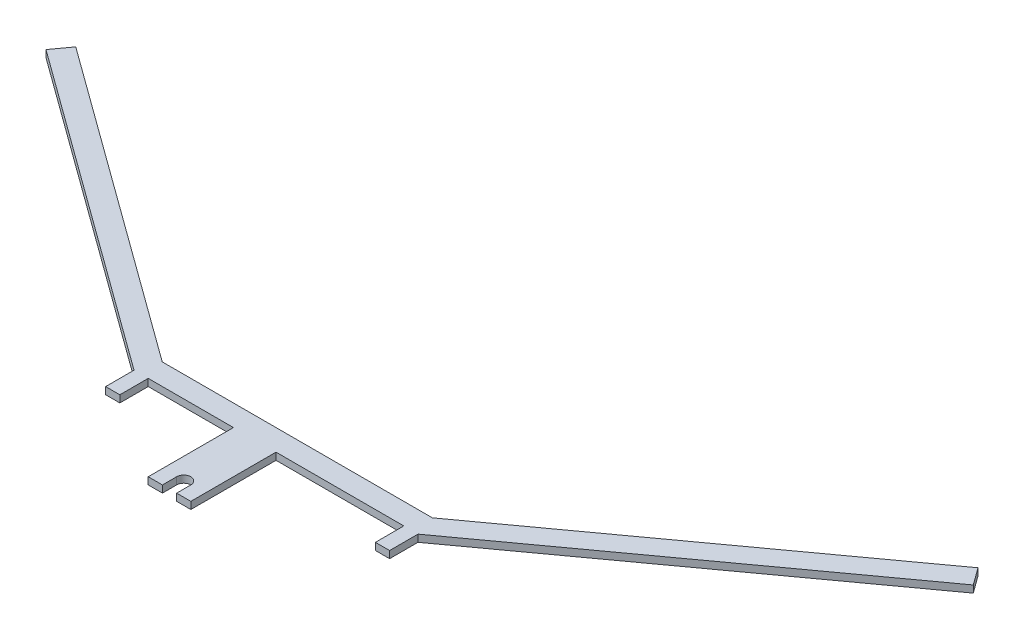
ISO-10303-21;
HEADER;
FILE_DESCRIPTION(('STEP AP214'),'2;1');
FILE_NAME('part.step','',(''),(''),'','','');
FILE_SCHEMA(('AUTOMOTIVE_DESIGN { 1 0 10303 214 1 1 1 1 }'));
ENDSEC;
DATA;
#1=APPLICATION_CONTEXT('core data for automotive mechanical design processes');
#2=APPLICATION_PROTOCOL_DEFINITION('international standard','automotive_design',2000,#1);
#3=PRODUCT_CONTEXT('',#1,'mechanical');
#4=PRODUCT('Part','Part','',(#3));
#5=PRODUCT_RELATED_PRODUCT_CATEGORY('part','',(#4));
#6=PRODUCT_DEFINITION_FORMATION('','',#4);
#7=PRODUCT_DEFINITION_CONTEXT('part definition',#1,'design');
#8=PRODUCT_DEFINITION('design','',#6,#7);
#9=PRODUCT_DEFINITION_SHAPE('','',#8);
#10=(LENGTH_UNIT() NAMED_UNIT(*) SI_UNIT(.MILLI.,.METRE.));
#11=(NAMED_UNIT(*) PLANE_ANGLE_UNIT() SI_UNIT($,.RADIAN.));
#12=(NAMED_UNIT(*) SI_UNIT($,.STERADIAN.) SOLID_ANGLE_UNIT());
#13=UNCERTAINTY_MEASURE_WITH_UNIT(LENGTH_MEASURE(1.E-05),#10,'distance_accuracy_value','');
#14=(GEOMETRIC_REPRESENTATION_CONTEXT(3) GLOBAL_UNCERTAINTY_ASSIGNED_CONTEXT((#13)) GLOBAL_UNIT_ASSIGNED_CONTEXT((#10,
#11,#12)) REPRESENTATION_CONTEXT('',''));
#15=CARTESIAN_POINT('',(0.,0.,0.));
#16=DIRECTION('',(0.,0.,1.));
#17=DIRECTION('',(1.,0.,0.));
#18=AXIS2_PLACEMENT_3D('',#15,#16,#17);
#19=CARTESIAN_POINT('',(0.,6.95820393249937,52.5));
#20=DIRECTION('',(0.,0.,1.));
#21=DIRECTION('',(1.,0.,0.));
#22=AXIS2_PLACEMENT_3D('',#19,#20,#21);
#23=PLANE('',#22);
#24=DIRECTION('',(0.,-1.,0.));
#25=VECTOR('',#24,1.);
#26=CARTESIAN_POINT('',(-2.00000000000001,6.95820393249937,52.5));
#27=LINE('',#26,#25);
#28=CARTESIAN_POINT('',(-2.00000000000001,0.250000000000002,52.5));
#29=VERTEX_POINT('',#28);
#30=CARTESIAN_POINT('',(-2.00000000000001,-0.25,52.5));
#31=VERTEX_POINT('',#30);
#32=EDGE_CURVE('E11',#29,#31,#27,.T.);
#33=ORIENTED_EDGE('',*,*,#32,.F.);
#34=DIRECTION('',(-1.,0.,0.));
#35=VECTOR('',#34,1.);
#36=CARTESIAN_POINT('',(0.,0.25,52.5));
#37=LINE('',#36,#35);
#38=CARTESIAN_POINT('',(-3.00000000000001,0.250000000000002,52.5));
#39=VERTEX_POINT('',#38);
#40=EDGE_CURVE('E240',#29,#39,#37,.T.);
#41=ORIENTED_EDGE('',*,*,#40,.T.);
#42=DIRECTION('',(0.,-1.,0.));
#43=VECTOR('',#42,1.);
#44=CARTESIAN_POINT('',(-3.00000000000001,6.95820393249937,52.5));
#45=LINE('',#44,#43);
#46=CARTESIAN_POINT('',(-3.00000000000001,-0.25,52.5));
#47=VERTEX_POINT('',#46);
#48=EDGE_CURVE('E250',#39,#47,#45,.T.);
#49=ORIENTED_EDGE('',*,*,#48,.T.);
#50=DIRECTION('',(-1.,0.,0.));
#51=VECTOR('',#50,1.);
#52=CARTESIAN_POINT('',(0.,-0.25,52.5));
#53=LINE('',#52,#51);
#54=EDGE_CURVE('E244',#31,#47,#53,.T.);
#55=ORIENTED_EDGE('',*,*,#54,.F.);
#56=EDGE_LOOP('',(#33,#41,#49,#55));
#57=FACE_BOUND('',#56,.T.);
#58=ADVANCED_FACE('F35',(#57),#23,.T.);
#59=CARTESIAN_POINT('',(-9.99999999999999,0.25,46.5));
#60=DIRECTION('',(0.,0.,-1.));
#61=DIRECTION('',(-1.,0.,0.));
#62=AXIS2_PLACEMENT_3D('',#59,#60,#61);
#63=PLANE('',#62);
#64=DIRECTION('',(1.,0.,0.));
#65=VECTOR('',#64,1.);
#66=CARTESIAN_POINT('',(-9.99999999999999,-0.25,46.5));
#67=LINE('',#66,#65);
#68=CARTESIAN_POINT('',(-8.99999999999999,-0.25,46.5));
#69=VERTEX_POINT('',#68);
#70=CARTESIAN_POINT('',(-3.00000000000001,-0.25,46.5));
#71=VERTEX_POINT('',#70);
#72=EDGE_CURVE('E315',#69,#71,#67,.T.);
#73=ORIENTED_EDGE('',*,*,#72,.T.);
#74=DIRECTION('',(0.,-1.,0.));
#75=VECTOR('',#74,1.);
#76=CARTESIAN_POINT('',(-3.00000000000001,6.95820393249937,46.5));
#77=LINE('',#76,#75);
#78=CARTESIAN_POINT('',(-3.00000000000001,0.25,46.5));
#79=VERTEX_POINT('',#78);
#80=EDGE_CURVE('E259',#79,#71,#77,.T.);
#81=ORIENTED_EDGE('',*,*,#80,.F.);
#82=DIRECTION('',(1.,0.,0.));
#83=VECTOR('',#82,1.);
#84=CARTESIAN_POINT('',(-9.99999999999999,0.25,46.5));
#85=LINE('',#84,#83);
#86=CARTESIAN_POINT('',(-8.99999999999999,0.25,46.5));
#87=VERTEX_POINT('',#86);
#88=EDGE_CURVE('E297',#87,#79,#85,.T.);
#89=ORIENTED_EDGE('',*,*,#88,.F.);
#90=DIRECTION('',(0.,1.,0.));
#91=VECTOR('',#90,1.);
#92=CARTESIAN_POINT('',(-8.99999999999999,-2.48606797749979,46.5));
#93=LINE('',#92,#91);
#94=EDGE_CURVE('E270',#69,#87,#93,.T.);
#95=ORIENTED_EDGE('',*,*,#94,.F.);
#96=EDGE_LOOP('',(#73,#81,#89,#95));
#97=FACE_BOUND('',#96,.T.);
#98=ADVANCED_FACE('F414',(#97),#63,.F.);
#99=CARTESIAN_POINT('',(0.,-0.25,46.5));
#100=VERTEX_POINT('',#99);
#101=CARTESIAN_POINT('',(8.99999999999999,-0.25,46.5));
#102=VERTEX_POINT('',#101);
#103=EDGE_CURVE('E55',#100,#102,#67,.T.);
#104=ORIENTED_EDGE('',*,*,#103,.T.);
#105=DIRECTION('',(0.,-1.,0.));
#106=VECTOR('',#105,1.);
#107=CARTESIAN_POINT('',(8.99999999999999,2.48606797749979,46.5));
#108=LINE('',#107,#106);
#109=CARTESIAN_POINT('',(8.99999999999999,0.25,46.5));
#110=VERTEX_POINT('',#109);
#111=EDGE_CURVE('E50',#110,#102,#108,.T.);
#112=ORIENTED_EDGE('',*,*,#111,.F.);
#113=CARTESIAN_POINT('',(0.,0.25,46.5));
#114=VERTEX_POINT('',#113);
#115=EDGE_CURVE('E296',#114,#110,#85,.T.);
#116=ORIENTED_EDGE('',*,*,#115,.F.);
#117=DIRECTION('',(0.,-1.,0.));
#118=VECTOR('',#117,1.);
#119=CARTESIAN_POINT('',(0.,6.95820393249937,46.5));
#120=LINE('',#119,#118);
#121=EDGE_CURVE('E255',#114,#100,#120,.T.);
#122=ORIENTED_EDGE('',*,*,#121,.T.);
#123=EDGE_LOOP('',(#104,#112,#116,#122));
#124=FACE_BOUND('',#123,.T.);
#125=ADVANCED_FACE('F443',(#124),#63,.F.);
#126=CARTESIAN_POINT('',(-31.7734222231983,0.25,28.831720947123));
#127=DIRECTION('',(0.809104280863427,0.,0.587665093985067));
#128=DIRECTION('',(0.587665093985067,0.,-0.809104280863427));
#129=AXIS2_PLACEMENT_3D('',#126,#127,#128);
#130=PLANE('',#129);
#131=DIRECTION('',(-0.587665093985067,0.,0.809104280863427));
#132=VECTOR('',#131,1.);
#133=CARTESIAN_POINT('',(-31.7734222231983,-0.25,28.831720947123));
#134=LINE('',#133,#132);
#135=CARTESIAN_POINT('',(-31.7734222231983,-0.25,28.831720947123));
#136=VERTEX_POINT('',#135);
#137=CARTESIAN_POINT('',(-32.6549198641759,-0.25,30.0453773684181));
#138=VERTEX_POINT('',#137);
#139=EDGE_CURVE('E289',#136,#138,#134,.T.);
#140=ORIENTED_EDGE('',*,*,#139,.T.);
#141=DIRECTION('',(0.,-1.,0.));
#142=VECTOR('',#141,1.);
#143=CARTESIAN_POINT('',(-32.6549198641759,0.25,30.0453773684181));
#144=LINE('',#143,#142);
#145=CARTESIAN_POINT('',(-32.6549198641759,0.25,30.0453773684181));
#146=VERTEX_POINT('',#145);
#147=EDGE_CURVE('E344',#146,#138,#144,.T.);
#148=ORIENTED_EDGE('',*,*,#147,.F.);
#149=DIRECTION('',(-0.587665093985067,0.,0.809104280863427));
#150=VECTOR('',#149,1.);
#151=CARTESIAN_POINT('',(-31.7734222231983,0.25,28.831720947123));
#152=LINE('',#151,#150);
#153=CARTESIAN_POINT('',(-31.7734222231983,0.25,28.831720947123));
#154=VERTEX_POINT('',#153);
#155=EDGE_CURVE('E290',#154,#146,#152,.T.);
#156=ORIENTED_EDGE('',*,*,#155,.F.);
#157=DIRECTION('',(0.,-1.,0.));
#158=VECTOR('',#157,1.);
#159=CARTESIAN_POINT('',(-31.7734222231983,0.25,28.831720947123));
#160=LINE('',#159,#158);
#161=EDGE_CURVE('E310',#154,#136,#160,.T.);
#162=ORIENTED_EDGE('',*,*,#161,.T.);
#163=EDGE_LOOP('',(#140,#148,#156,#162));
#164=FACE_BOUND('',#163,.T.);
#165=ADVANCED_FACE('F37',(#164),#130,.F.);
#166=CARTESIAN_POINT('',(-32.6549198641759,0.25,30.0453773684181));
#167=DIRECTION('',(0.587665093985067,0.,-0.809104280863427));
#168=DIRECTION('',(-0.809104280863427,0.,-0.587665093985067));
#169=AXIS2_PLACEMENT_3D('',#166,#167,#168);
#170=PLANE('',#169);
#171=DIRECTION('',(0.809104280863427,0.,0.587665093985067));
#172=VECTOR('',#171,1.);
#173=CARTESIAN_POINT('',(-32.6549198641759,-0.25,30.0453773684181));
#174=LINE('',#173,#172);
#175=CARTESIAN_POINT('',(-9.99999999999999,-0.25,46.5));
#176=VERTEX_POINT('',#175);
#177=EDGE_CURVE('E313',#138,#176,#174,.T.);
#178=ORIENTED_EDGE('',*,*,#177,.T.);
#179=DIRECTION('',(0.,-1.,0.));
#180=VECTOR('',#179,1.);
#181=CARTESIAN_POINT('',(-9.99999999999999,0.25,46.5));
#182=LINE('',#181,#180);
#183=CARTESIAN_POINT('',(-9.99999999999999,0.25,46.5));
#184=VERTEX_POINT('',#183);
#185=EDGE_CURVE('E341',#184,#176,#182,.T.);
#186=ORIENTED_EDGE('',*,*,#185,.F.);
#187=DIRECTION('',(0.809104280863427,0.,0.587665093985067));
#188=VECTOR('',#187,1.);
#189=CARTESIAN_POINT('',(-32.6549198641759,0.25,30.0453773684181));
#190=LINE('',#189,#188);
#191=EDGE_CURVE('E293',#146,#184,#190,.T.);
#192=ORIENTED_EDGE('',*,*,#191,.F.);
#193=ORIENTED_EDGE('',*,*,#147,.T.);
#194=EDGE_LOOP('',(#178,#186,#192,#193));
#195=FACE_BOUND('',#194,.T.);
#196=ADVANCED_FACE('F397',(#195),#170,.F.);
#197=CARTESIAN_POINT('',(32.654919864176,0.25,30.0453773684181));
#198=DIRECTION('',(-0.587665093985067,0.,-0.809104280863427));
#199=DIRECTION('',(-0.809104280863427,0.,0.587665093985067));
#200=AXIS2_PLACEMENT_3D('',#197,#198,#199);
#201=PLANE('',#200);
#202=DIRECTION('',(0.809104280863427,0.,-0.587665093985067));
#203=VECTOR('',#202,1.);
#204=CARTESIAN_POINT('',(32.654919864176,-0.25,30.0453773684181));
#205=LINE('',#204,#203);
#206=CARTESIAN_POINT('',(9.99999999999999,-0.25,46.5));
#207=VERTEX_POINT('',#206);
#208=CARTESIAN_POINT('',(32.654919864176,-0.25,30.0453773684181));
#209=VERTEX_POINT('',#208);
#210=EDGE_CURVE('E317',#207,#209,#205,.T.);
#211=ORIENTED_EDGE('',*,*,#210,.T.);
#212=DIRECTION('',(0.,-1.,0.));
#213=VECTOR('',#212,1.);
#214=CARTESIAN_POINT('',(32.654919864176,0.25,30.0453773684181));
#215=LINE('',#214,#213);
#216=CARTESIAN_POINT('',(32.654919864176,0.25,30.0453773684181));
#217=VERTEX_POINT('',#216);
#218=EDGE_CURVE('E337',#217,#209,#215,.T.);
#219=ORIENTED_EDGE('',*,*,#218,.F.);
#220=DIRECTION('',(0.809104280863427,0.,-0.587665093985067));
#221=VECTOR('',#220,1.);
#222=CARTESIAN_POINT('',(32.654919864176,0.25,30.0453773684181));
#223=LINE('',#222,#221);
#224=CARTESIAN_POINT('',(9.99999999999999,0.25,46.5));
#225=VERTEX_POINT('',#224);
#226=EDGE_CURVE('E300',#225,#217,#223,.T.);
#227=ORIENTED_EDGE('',*,*,#226,.F.);
#228=DIRECTION('',(0.,-1.,0.));
#229=VECTOR('',#228,1.);
#230=CARTESIAN_POINT('',(10.,0.25,46.5));
#231=LINE('',#230,#229);
#232=EDGE_CURVE('E204',#225,#207,#231,.T.);
#233=ORIENTED_EDGE('',*,*,#232,.T.);
#234=EDGE_LOOP('',(#211,#219,#227,#233));
#235=FACE_BOUND('',#234,.T.);
#236=ADVANCED_FACE('F372',(#235),#201,.F.);
#237=CARTESIAN_POINT('',(31.7734222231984,0.25,28.831720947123));
#238=DIRECTION('',(-0.809104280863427,0.,0.587665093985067));
#239=DIRECTION('',(0.587665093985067,0.,0.809104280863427));
#240=AXIS2_PLACEMENT_3D('',#237,#238,#239);
#241=PLANE('',#240);
#242=DIRECTION('',(-0.587665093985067,0.,-0.809104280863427));
#243=VECTOR('',#242,1.);
#244=CARTESIAN_POINT('',(31.7734222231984,-0.25,28.831720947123));
#245=LINE('',#244,#243);
#246=CARTESIAN_POINT('',(31.7734222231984,-0.25,28.831720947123));
#247=VERTEX_POINT('',#246);
#248=EDGE_CURVE('E319',#209,#247,#245,.T.);
#249=ORIENTED_EDGE('',*,*,#248,.T.);
#250=DIRECTION('',(0.,-1.,0.));
#251=VECTOR('',#250,1.);
#252=CARTESIAN_POINT('',(31.7734222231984,0.25,28.831720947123));
#253=LINE('',#252,#251);
#254=CARTESIAN_POINT('',(31.7734222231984,0.25,28.831720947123));
#255=VERTEX_POINT('',#254);
#256=EDGE_CURVE('E334',#255,#247,#253,.T.);
#257=ORIENTED_EDGE('',*,*,#256,.F.);
#258=DIRECTION('',(-0.587665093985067,0.,-0.809104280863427));
#259=VECTOR('',#258,1.);
#260=CARTESIAN_POINT('',(31.7734222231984,0.25,28.831720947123));
#261=LINE('',#260,#259);
#262=EDGE_CURVE('E302',#217,#255,#261,.T.);
#263=ORIENTED_EDGE('',*,*,#262,.F.);
#264=ORIENTED_EDGE('',*,*,#218,.T.);
#265=EDGE_LOOP('',(#249,#257,#263,#264));
#266=FACE_BOUND('',#265,.T.);
#267=ADVANCED_FACE('F375',(#266),#241,.F.);
#268=CARTESIAN_POINT('',(31.7734222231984,0.25,28.831720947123));
#269=DIRECTION('',(0.587665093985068,0.,0.809104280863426));
#270=DIRECTION('',(0.809104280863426,0.,-0.587665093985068));
#271=AXIS2_PLACEMENT_3D('',#268,#269,#270);
#272=PLANE('',#271);
#273=DIRECTION('',(-0.809104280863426,0.,0.587665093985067));
#274=VECTOR('',#273,1.);
#275=CARTESIAN_POINT('',(31.7734222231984,-0.25,28.831720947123));
#276=LINE('',#275,#274);
#277=CARTESIAN_POINT('',(9.51274359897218,-0.25,45.));
#278=VERTEX_POINT('',#277);
#279=EDGE_CURVE('E321',#247,#278,#276,.T.);
#280=ORIENTED_EDGE('',*,*,#279,.T.);
#281=DIRECTION('',(0.,-1.,0.));
#282=VECTOR('',#281,1.);
#283=CARTESIAN_POINT('',(9.51274359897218,0.25,45.));
#284=LINE('',#283,#282);
#285=CARTESIAN_POINT('',(9.51274359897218,0.25,45.));
#286=VERTEX_POINT('',#285);
#287=EDGE_CURVE('E331',#286,#278,#284,.T.);
#288=ORIENTED_EDGE('',*,*,#287,.F.);
#289=DIRECTION('',(-0.809104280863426,0.,0.587665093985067));
#290=VECTOR('',#289,1.);
#291=CARTESIAN_POINT('',(31.7734222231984,0.25,28.831720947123));
#292=LINE('',#291,#290);
#293=EDGE_CURVE('E304',#255,#286,#292,.T.);
#294=ORIENTED_EDGE('',*,*,#293,.F.);
#295=ORIENTED_EDGE('',*,*,#256,.T.);
#296=EDGE_LOOP('',(#280,#288,#294,#295));
#297=FACE_BOUND('',#296,.T.);
#298=ADVANCED_FACE('F382',(#297),#272,.F.);
#299=CARTESIAN_POINT('',(-9.51274359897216,0.25,45.));
#300=DIRECTION('',(0.,0.,1.));
#301=DIRECTION('',(1.,0.,0.));
#302=AXIS2_PLACEMENT_3D('',#299,#300,#301);
#303=PLANE('',#302);
#304=DIRECTION('',(-1.,0.,0.));
#305=VECTOR('',#304,1.);
#306=CARTESIAN_POINT('',(-9.51274359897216,-0.25,45.));
#307=LINE('',#306,#305);
#308=CARTESIAN_POINT('',(-9.51274359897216,-0.25,45.));
#309=VERTEX_POINT('',#308);
#310=EDGE_CURVE('E323',#278,#309,#307,.T.);
#311=ORIENTED_EDGE('',*,*,#310,.T.);
#312=DIRECTION('',(0.,-1.,0.));
#313=VECTOR('',#312,1.);
#314=CARTESIAN_POINT('',(-9.51274359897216,0.25,45.));
#315=LINE('',#314,#313);
#316=CARTESIAN_POINT('',(-9.51274359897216,0.25,45.));
#317=VERTEX_POINT('',#316);
#318=EDGE_CURVE('E328',#317,#309,#315,.T.);
#319=ORIENTED_EDGE('',*,*,#318,.F.);
#320=DIRECTION('',(-1.,0.,0.));
#321=VECTOR('',#320,1.);
#322=CARTESIAN_POINT('',(-9.51274359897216,0.25,45.));
#323=LINE('',#322,#321);
#324=EDGE_CURVE('E306',#286,#317,#323,.T.);
#325=ORIENTED_EDGE('',*,*,#324,.F.);
#326=ORIENTED_EDGE('',*,*,#287,.T.);
#327=EDGE_LOOP('',(#311,#319,#325,#326));
#328=FACE_BOUND('',#327,.T.);
#329=ADVANCED_FACE('F385',(#328),#303,.F.);
#330=CARTESIAN_POINT('',(-31.7734222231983,0.25,28.831720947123));
#331=DIRECTION('',(-0.587665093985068,0.,0.809104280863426));
#332=DIRECTION('',(0.809104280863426,0.,0.587665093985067));
#333=AXIS2_PLACEMENT_3D('',#330,#331,#332);
#334=PLANE('',#333);
#335=DIRECTION('',(-0.809104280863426,0.,-0.587665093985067));
#336=VECTOR('',#335,1.);
#337=CARTESIAN_POINT('',(-31.7734222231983,-0.25,28.831720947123));
#338=LINE('',#337,#336);
#339=EDGE_CURVE('E294',#309,#136,#338,.T.);
#340=ORIENTED_EDGE('',*,*,#339,.T.);
#341=ORIENTED_EDGE('',*,*,#161,.F.);
#342=DIRECTION('',(-0.809104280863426,0.,-0.587665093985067));
#343=VECTOR('',#342,1.);
#344=CARTESIAN_POINT('',(-31.7734222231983,0.25,28.831720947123));
#345=LINE('',#344,#343);
#346=EDGE_CURVE('E308',#317,#154,#345,.T.);
#347=ORIENTED_EDGE('',*,*,#346,.F.);
#348=ORIENTED_EDGE('',*,*,#318,.T.);
#349=EDGE_LOOP('',(#340,#341,#347,#348));
#350=FACE_BOUND('',#349,.T.);
#351=ADVANCED_FACE('F390',(#350),#334,.F.);
#352=CARTESIAN_POINT('',(0.,0.25,0.));
#353=DIRECTION('',(0.,1.,0.));
#354=DIRECTION('',(0.,0.,1.));
#355=AXIS2_PLACEMENT_3D('',#352,#353,#354);
#356=PLANE('',#355);
#357=DIRECTION('',(0.,0.,-1.));
#358=VECTOR('',#357,1.);
#359=CARTESIAN_POINT('',(-2.00000000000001,0.250000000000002,51.5));
#360=LINE('',#359,#358);
#361=CARTESIAN_POINT('',(-2.00000000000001,0.250000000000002,51.5));
#362=VERTEX_POINT('',#361);
#363=EDGE_CURVE('E224',#29,#362,#360,.T.);
#364=ORIENTED_EDGE('',*,*,#363,.T.);
#365=CARTESIAN_POINT('',(-1.50000000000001,0.250000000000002,51.5));
#366=DIRECTION('',(0.,-1.,0.));
#367=DIRECTION('',(0.,0.,-1.));
#368=AXIS2_PLACEMENT_3D('',#365,#366,#367);
#369=CIRCLE('',#368,0.5);
#370=CARTESIAN_POINT('',(-1.00000000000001,0.250000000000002,51.5));
#371=VERTEX_POINT('',#370);
#372=EDGE_CURVE('E217',#362,#371,#369,.T.);
#373=ORIENTED_EDGE('',*,*,#372,.T.);
#374=DIRECTION('',(0.,0.,1.));
#375=VECTOR('',#374,1.);
#376=CARTESIAN_POINT('',(-1.00000000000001,0.250000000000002,55.2784134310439));
#377=LINE('',#376,#375);
#378=CARTESIAN_POINT('',(-1.00000000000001,0.250000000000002,52.5));
#379=VERTEX_POINT('',#378);
#380=EDGE_CURVE('E220',#371,#379,#377,.T.);
#381=ORIENTED_EDGE('',*,*,#380,.T.);
#382=CARTESIAN_POINT('',(0.,0.25,52.5));
#383=VERTEX_POINT('',#382);
#384=EDGE_CURVE('E247',#383,#379,#37,.T.);
#385=ORIENTED_EDGE('',*,*,#384,.F.);
#386=DIRECTION('',(0.,0.,1.));
#387=VECTOR('',#386,1.);
#388=CARTESIAN_POINT('',(0.,0.25,46.5));
#389=LINE('',#388,#387);
#390=EDGE_CURVE('E251',#114,#383,#389,.T.);
#391=ORIENTED_EDGE('',*,*,#390,.F.);
#392=ORIENTED_EDGE('',*,*,#115,.T.);
#393=DIRECTION('',(0.,0.,-1.));
#394=VECTOR('',#393,1.);
#395=CARTESIAN_POINT('',(8.99999999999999,0.25,48.5));
#396=LINE('',#395,#394);
#397=CARTESIAN_POINT('',(8.99999999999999,0.25,48.5));
#398=VERTEX_POINT('',#397);
#399=EDGE_CURVE('E189',#398,#110,#396,.T.);
#400=ORIENTED_EDGE('',*,*,#399,.F.);
#401=DIRECTION('',(-1.,0.,0.));
#402=VECTOR('',#401,1.);
#403=CARTESIAN_POINT('',(9.99999999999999,0.25,48.5));
#404=LINE('',#403,#402);
#405=CARTESIAN_POINT('',(9.99999999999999,0.25,48.5));
#406=VERTEX_POINT('',#405);
#407=EDGE_CURVE('E181',#406,#398,#404,.T.);
#408=ORIENTED_EDGE('',*,*,#407,.F.);
#409=DIRECTION('',(0.,0.,1.));
#410=VECTOR('',#409,1.);
#411=CARTESIAN_POINT('',(9.99999999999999,0.25,46.5));
#412=LINE('',#411,#410);
#413=EDGE_CURVE('E186',#225,#406,#412,.T.);
#414=ORIENTED_EDGE('',*,*,#413,.F.);
#415=ORIENTED_EDGE('',*,*,#226,.T.);
#416=ORIENTED_EDGE('',*,*,#262,.T.);
#417=ORIENTED_EDGE('',*,*,#293,.T.);
#418=ORIENTED_EDGE('',*,*,#324,.T.);
#419=ORIENTED_EDGE('',*,*,#346,.T.);
#420=ORIENTED_EDGE('',*,*,#155,.T.);
#421=ORIENTED_EDGE('',*,*,#191,.T.);
#422=DIRECTION('',(0.,0.,1.));
#423=VECTOR('',#422,1.);
#424=CARTESIAN_POINT('',(-9.99999999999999,0.25,46.5));
#425=LINE('',#424,#423);
#426=CARTESIAN_POINT('',(-9.99999999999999,0.25,48.5));
#427=VERTEX_POINT('',#426);
#428=EDGE_CURVE('E266',#184,#427,#425,.T.);
#429=ORIENTED_EDGE('',*,*,#428,.T.);
#430=DIRECTION('',(1.,0.,0.));
#431=VECTOR('',#430,1.);
#432=CARTESIAN_POINT('',(-9.99999999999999,0.25,48.5));
#433=LINE('',#432,#431);
#434=CARTESIAN_POINT('',(-8.99999999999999,0.25,48.5));
#435=VERTEX_POINT('',#434);
#436=EDGE_CURVE('E276',#427,#435,#433,.T.);
#437=ORIENTED_EDGE('',*,*,#436,.T.);
#438=DIRECTION('',(0.,0.,-1.));
#439=VECTOR('',#438,1.);
#440=CARTESIAN_POINT('',(-8.99999999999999,0.25,46.5));
#441=LINE('',#440,#439);
#442=EDGE_CURVE('E279',#435,#87,#441,.T.);
#443=ORIENTED_EDGE('',*,*,#442,.T.);
#444=ORIENTED_EDGE('',*,*,#88,.T.);
#445=DIRECTION('',(0.,0.,-1.));
#446=VECTOR('',#445,1.);
#447=CARTESIAN_POINT('',(-3.00000000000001,0.25,46.5));
#448=LINE('',#447,#446);
#449=EDGE_CURVE('E256',#39,#79,#448,.T.);
#450=ORIENTED_EDGE('',*,*,#449,.F.);
#451=ORIENTED_EDGE('',*,*,#40,.F.);
#452=EDGE_LOOP('',(#364,#373,#381,#385,#391,#392,#400,#408,#414,#415,#416,#417,#418,#419,#420,
#421,#429,#437,#443,#444,#450,#451));
#453=FACE_BOUND('',#452,.T.);
#454=ADVANCED_FACE('F184',(#453),#356,.T.);
#455=CARTESIAN_POINT('',(0.,-0.25,0.));
#456=DIRECTION('',(0.,1.,0.));
#457=DIRECTION('',(0.,0.,1.));
#458=AXIS2_PLACEMENT_3D('',#455,#456,#457);
#459=PLANE('',#458);
#460=CARTESIAN_POINT('',(-1.50000000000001,-0.25,51.5));
#461=DIRECTION('',(0.,-1.,0.));
#462=DIRECTION('',(0.,0.,-1.));
#463=AXIS2_PLACEMENT_3D('',#460,#461,#462);
#464=CIRCLE('',#463,0.5);
#465=CARTESIAN_POINT('',(-2.00000000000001,-0.25,51.5));
#466=VERTEX_POINT('',#465);
#467=CARTESIAN_POINT('',(-1.00000000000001,-0.25,51.5));
#468=VERTEX_POINT('',#467);
#469=EDGE_CURVE('E215',#466,#468,#464,.T.);
#470=ORIENTED_EDGE('',*,*,#469,.F.);
#471=DIRECTION('',(0.,0.,-1.));
#472=VECTOR('',#471,1.);
#473=CARTESIAN_POINT('',(-2.00000000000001,-0.25,51.5));
#474=LINE('',#473,#472);
#475=EDGE_CURVE('E221',#31,#466,#474,.T.);
#476=ORIENTED_EDGE('',*,*,#475,.F.);
#477=ORIENTED_EDGE('',*,*,#54,.T.);
#478=DIRECTION('',(0.,0.,-1.));
#479=VECTOR('',#478,1.);
#480=CARTESIAN_POINT('',(-3.00000000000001,-0.25,46.5));
#481=LINE('',#480,#479);
#482=EDGE_CURVE('E237',#47,#71,#481,.T.);
#483=ORIENTED_EDGE('',*,*,#482,.T.);
#484=ORIENTED_EDGE('',*,*,#72,.F.);
#485=DIRECTION('',(0.,0.,1.));
#486=VECTOR('',#485,1.);
#487=CARTESIAN_POINT('',(-8.99999999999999,-0.25,46.5));
#488=LINE('',#487,#486);
#489=CARTESIAN_POINT('',(-8.99999999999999,-0.25,48.5));
#490=VERTEX_POINT('',#489);
#491=EDGE_CURVE('E267',#69,#490,#488,.T.);
#492=ORIENTED_EDGE('',*,*,#491,.T.);
#493=DIRECTION('',(-1.,0.,0.));
#494=VECTOR('',#493,1.);
#495=CARTESIAN_POINT('',(-9.99999999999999,-0.25,48.5));
#496=LINE('',#495,#494);
#497=CARTESIAN_POINT('',(-9.99999999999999,-0.25,48.5));
#498=VERTEX_POINT('',#497);
#499=EDGE_CURVE('E273',#490,#498,#496,.T.);
#500=ORIENTED_EDGE('',*,*,#499,.T.);
#501=DIRECTION('',(0.,0.,-1.));
#502=VECTOR('',#501,1.);
#503=CARTESIAN_POINT('',(-9.99999999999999,-0.25,46.5));
#504=LINE('',#503,#502);
#505=EDGE_CURVE('E269',#498,#176,#504,.T.);
#506=ORIENTED_EDGE('',*,*,#505,.T.);
#507=ORIENTED_EDGE('',*,*,#177,.F.);
#508=ORIENTED_EDGE('',*,*,#139,.F.);
#509=ORIENTED_EDGE('',*,*,#339,.F.);
#510=ORIENTED_EDGE('',*,*,#310,.F.);
#511=ORIENTED_EDGE('',*,*,#279,.F.);
#512=ORIENTED_EDGE('',*,*,#248,.F.);
#513=ORIENTED_EDGE('',*,*,#210,.F.);
#514=DIRECTION('',(0.,0.,1.));
#515=VECTOR('',#514,1.);
#516=CARTESIAN_POINT('',(9.99999999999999,-0.25,46.5));
#517=LINE('',#516,#515);
#518=CARTESIAN_POINT('',(9.99999999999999,-0.25,48.5));
#519=VERTEX_POINT('',#518);
#520=EDGE_CURVE('E211',#207,#519,#517,.T.);
#521=ORIENTED_EDGE('',*,*,#520,.T.);
#522=DIRECTION('',(-1.,0.,0.));
#523=VECTOR('',#522,1.);
#524=CARTESIAN_POINT('',(9.99999999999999,-0.25,48.5));
#525=LINE('',#524,#523);
#526=CARTESIAN_POINT('',(8.99999999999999,-0.25,48.5));
#527=VERTEX_POINT('',#526);
#528=EDGE_CURVE('E198',#519,#527,#525,.T.);
#529=ORIENTED_EDGE('',*,*,#528,.T.);
#530=DIRECTION('',(0.,0.,-1.));
#531=VECTOR('',#530,1.);
#532=CARTESIAN_POINT('',(8.99999999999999,-0.25,48.5));
#533=LINE('',#532,#531);
#534=EDGE_CURVE('E205',#527,#102,#533,.T.);
#535=ORIENTED_EDGE('',*,*,#534,.T.);
#536=ORIENTED_EDGE('',*,*,#103,.F.);
#537=DIRECTION('',(0.,0.,1.));
#538=VECTOR('',#537,1.);
#539=CARTESIAN_POINT('',(0.,-0.25,46.5));
#540=LINE('',#539,#538);
#541=CARTESIAN_POINT('',(0.,-0.25,52.5));
#542=VERTEX_POINT('',#541);
#543=EDGE_CURVE('E235',#100,#542,#540,.T.);
#544=ORIENTED_EDGE('',*,*,#543,.T.);
#545=CARTESIAN_POINT('',(-1.00000000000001,-0.25,52.5));
#546=VERTEX_POINT('',#545);
#547=EDGE_CURVE('E241',#542,#546,#53,.T.);
#548=ORIENTED_EDGE('',*,*,#547,.T.);
#549=DIRECTION('',(0.,0.,1.));
#550=VECTOR('',#549,1.);
#551=CARTESIAN_POINT('',(-1.00000000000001,-0.25,55.2784134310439));
#552=LINE('',#551,#550);
#553=EDGE_CURVE('E229',#468,#546,#552,.T.);
#554=ORIENTED_EDGE('',*,*,#553,.F.);
#555=EDGE_LOOP('',(#470,#476,#477,#483,#484,#492,#500,#506,#507,#508,#509,#510,#511,#512,#513,
#521,#529,#535,#536,#544,#548,#554));
#556=FACE_BOUND('',#555,.T.);
#557=ADVANCED_FACE('F366',(#556),#459,.F.);
#558=CARTESIAN_POINT('',(-9.99999999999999,-2.48606797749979,46.5));
#559=DIRECTION('',(-1.,0.,0.));
#560=DIRECTION('',(0.,0.,1.));
#561=AXIS2_PLACEMENT_3D('',#558,#559,#560);
#562=PLANE('',#561);
#563=ORIENTED_EDGE('',*,*,#505,.F.);
#564=DIRECTION('',(0.,1.,0.));
#565=VECTOR('',#564,1.);
#566=CARTESIAN_POINT('',(-9.99999999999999,-2.48606797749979,48.5));
#567=LINE('',#566,#565);
#568=EDGE_CURVE('E282',#498,#427,#567,.T.);
#569=ORIENTED_EDGE('',*,*,#568,.T.);
#570=ORIENTED_EDGE('',*,*,#428,.F.);
#571=ORIENTED_EDGE('',*,*,#185,.T.);
#572=EDGE_LOOP('',(#563,#569,#570,#571));
#573=FACE_BOUND('',#572,.T.);
#574=ADVANCED_FACE('F401',(#573),#562,.T.);
#575=CARTESIAN_POINT('',(-8.99999999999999,-2.48606797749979,46.5));
#576=DIRECTION('',(1.,0.,0.));
#577=DIRECTION('',(0.,0.,-1.));
#578=AXIS2_PLACEMENT_3D('',#575,#576,#577);
#579=PLANE('',#578);
#580=ORIENTED_EDGE('',*,*,#491,.F.);
#581=ORIENTED_EDGE('',*,*,#94,.T.);
#582=ORIENTED_EDGE('',*,*,#442,.F.);
#583=DIRECTION('',(0.,1.,0.));
#584=VECTOR('',#583,1.);
#585=CARTESIAN_POINT('',(-8.99999999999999,-2.48606797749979,48.5));
#586=LINE('',#585,#584);
#587=EDGE_CURVE('E285',#490,#435,#586,.T.);
#588=ORIENTED_EDGE('',*,*,#587,.F.);
#589=EDGE_LOOP('',(#580,#581,#582,#588));
#590=FACE_BOUND('',#589,.T.);
#591=ADVANCED_FACE('F411',(#590),#579,.T.);
#592=CARTESIAN_POINT('',(-9.99999999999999,-2.48606797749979,48.5));
#593=DIRECTION('',(0.,0.,1.));
#594=DIRECTION('',(1.,0.,0.));
#595=AXIS2_PLACEMENT_3D('',#592,#593,#594);
#596=PLANE('',#595);
#597=ORIENTED_EDGE('',*,*,#499,.F.);
#598=ORIENTED_EDGE('',*,*,#587,.T.);
#599=ORIENTED_EDGE('',*,*,#436,.F.);
#600=ORIENTED_EDGE('',*,*,#568,.F.);
#601=EDGE_LOOP('',(#597,#598,#599,#600));
#602=FACE_BOUND('',#601,.T.);
#603=ADVANCED_FACE('F407',(#602),#596,.T.);
#604=DIRECTION('',(0.,1.,0.));
#605=VECTOR('',#604,1.);
#606=CARTESIAN_POINT('',(-1.00000000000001,6.95820393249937,52.5));
#607=LINE('',#606,#605);
#608=EDGE_CURVE('E43',#546,#379,#607,.T.);
#609=ORIENTED_EDGE('',*,*,#608,.F.);
#610=ORIENTED_EDGE('',*,*,#547,.F.);
#611=DIRECTION('',(0.,-1.,0.));
#612=VECTOR('',#611,1.);
#613=CARTESIAN_POINT('',(0.,6.95820393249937,52.5));
#614=LINE('',#613,#612);
#615=EDGE_CURVE('E254',#383,#542,#614,.T.);
#616=ORIENTED_EDGE('',*,*,#615,.F.);
#617=ORIENTED_EDGE('',*,*,#384,.T.);
#618=EDGE_LOOP('',(#609,#610,#616,#617));
#619=FACE_BOUND('',#618,.T.);
#620=ADVANCED_FACE('F356',(#619),#23,.T.);
#621=CARTESIAN_POINT('',(-3.00000000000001,6.95820393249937,46.5));
#622=DIRECTION('',(-1.,0.,0.));
#623=DIRECTION('',(0.,0.,1.));
#624=AXIS2_PLACEMENT_3D('',#621,#622,#623);
#625=PLANE('',#624);
#626=ORIENTED_EDGE('',*,*,#48,.F.);
#627=ORIENTED_EDGE('',*,*,#449,.T.);
#628=ORIENTED_EDGE('',*,*,#80,.T.);
#629=ORIENTED_EDGE('',*,*,#482,.F.);
#630=EDGE_LOOP('',(#626,#627,#628,#629));
#631=FACE_BOUND('',#630,.T.);
#632=ADVANCED_FACE('F420',(#631),#625,.T.);
#633=CARTESIAN_POINT('',(0.,6.95820393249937,46.5));
#634=DIRECTION('',(1.,0.,0.));
#635=DIRECTION('',(0.,0.,-1.));
#636=AXIS2_PLACEMENT_3D('',#633,#634,#635);
#637=PLANE('',#636);
#638=ORIENTED_EDGE('',*,*,#121,.F.);
#639=ORIENTED_EDGE('',*,*,#390,.T.);
#640=ORIENTED_EDGE('',*,*,#615,.T.);
#641=ORIENTED_EDGE('',*,*,#543,.F.);
#642=EDGE_LOOP('',(#638,#639,#640,#641));
#643=FACE_BOUND('',#642,.T.);
#644=ADVANCED_FACE('F360',(#643),#637,.T.);
#645=CARTESIAN_POINT('',(-1.50000000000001,0.250000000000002,51.5));
#646=DIRECTION('',(0.,-1.,0.));
#647=DIRECTION('',(0.,0.,-1.));
#648=AXIS2_PLACEMENT_3D('',#645,#646,#647);
#649=CYLINDRICAL_SURFACE('',#648,0.5);
#650=ORIENTED_EDGE('',*,*,#469,.T.);
#651=DIRECTION('',(0.,-1.,0.));
#652=VECTOR('',#651,1.);
#653=CARTESIAN_POINT('',(-1.00000000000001,0.250000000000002,51.5));
#654=LINE('',#653,#652);
#655=EDGE_CURVE('E226',#371,#468,#654,.T.);
#656=ORIENTED_EDGE('',*,*,#655,.F.);
#657=ORIENTED_EDGE('',*,*,#372,.F.);
#658=DIRECTION('',(0.,-1.,0.));
#659=VECTOR('',#658,1.);
#660=CARTESIAN_POINT('',(-2.00000000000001,0.250000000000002,51.5));
#661=LINE('',#660,#659);
#662=EDGE_CURVE('E232',#362,#466,#661,.T.);
#663=ORIENTED_EDGE('',*,*,#662,.T.);
#664=EDGE_LOOP('',(#650,#656,#657,#663));
#665=FACE_BOUND('',#664,.T.);
#666=ADVANCED_FACE('F428',(#665),#649,.F.);
#667=CARTESIAN_POINT('',(-2.00000000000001,0.250000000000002,51.5));
#668=DIRECTION('',(-1.,0.,0.));
#669=DIRECTION('',(0.,0.,1.));
#670=AXIS2_PLACEMENT_3D('',#667,#668,#669);
#671=PLANE('',#670);
#672=ORIENTED_EDGE('',*,*,#32,.T.);
#673=ORIENTED_EDGE('',*,*,#475,.T.);
#674=ORIENTED_EDGE('',*,*,#662,.F.);
#675=ORIENTED_EDGE('',*,*,#363,.F.);
#676=EDGE_LOOP('',(#672,#673,#674,#675));
#677=FACE_BOUND('',#676,.T.);
#678=ADVANCED_FACE('F426',(#677),#671,.F.);
#679=CARTESIAN_POINT('',(-1.00000000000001,0.250000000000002,55.2784134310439));
#680=DIRECTION('',(1.,0.,0.));
#681=DIRECTION('',(0.,0.,-1.));
#682=AXIS2_PLACEMENT_3D('',#679,#680,#681);
#683=PLANE('',#682);
#684=ORIENTED_EDGE('',*,*,#608,.T.);
#685=ORIENTED_EDGE('',*,*,#380,.F.);
#686=ORIENTED_EDGE('',*,*,#655,.T.);
#687=ORIENTED_EDGE('',*,*,#553,.T.);
#688=EDGE_LOOP('',(#684,#685,#686,#687));
#689=FACE_BOUND('',#688,.T.);
#690=ADVANCED_FACE('F349',(#689),#683,.F.);
#691=CARTESIAN_POINT('',(9.99999999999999,2.48606797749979,46.5));
#692=DIRECTION('',(1.,0.,0.));
#693=DIRECTION('',(0.,0.,-1.));
#694=AXIS2_PLACEMENT_3D('',#691,#692,#693);
#695=PLANE('',#694);
#696=ORIENTED_EDGE('',*,*,#232,.F.);
#697=ORIENTED_EDGE('',*,*,#413,.T.);
#698=DIRECTION('',(0.,-1.,0.));
#699=VECTOR('',#698,1.);
#700=CARTESIAN_POINT('',(9.99999999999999,2.48606797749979,48.5));
#701=LINE('',#700,#699);
#702=EDGE_CURVE('E193',#406,#519,#701,.T.);
#703=ORIENTED_EDGE('',*,*,#702,.T.);
#704=ORIENTED_EDGE('',*,*,#520,.F.);
#705=EDGE_LOOP('',(#696,#697,#703,#704));
#706=FACE_BOUND('',#705,.T.);
#707=ADVANCED_FACE('F203',(#706),#695,.T.);
#708=CARTESIAN_POINT('',(9.99999999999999,2.48606797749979,48.5));
#709=DIRECTION('',(0.,0.,1.));
#710=DIRECTION('',(1.,0.,0.));
#711=AXIS2_PLACEMENT_3D('',#708,#709,#710);
#712=PLANE('',#711);
#713=ORIENTED_EDGE('',*,*,#702,.F.);
#714=ORIENTED_EDGE('',*,*,#407,.T.);
#715=DIRECTION('',(0.,-1.,0.));
#716=VECTOR('',#715,1.);
#717=CARTESIAN_POINT('',(8.99999999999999,2.48606797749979,48.5));
#718=LINE('',#717,#716);
#719=EDGE_CURVE('E192',#398,#527,#718,.T.);
#720=ORIENTED_EDGE('',*,*,#719,.T.);
#721=ORIENTED_EDGE('',*,*,#528,.F.);
#722=EDGE_LOOP('',(#713,#714,#720,#721));
#723=FACE_BOUND('',#722,.T.);
#724=ADVANCED_FACE('F196',(#723),#712,.T.);
#725=CARTESIAN_POINT('',(8.99999999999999,2.48606797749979,48.5));
#726=DIRECTION('',(-1.,0.,0.));
#727=DIRECTION('',(0.,0.,1.));
#728=AXIS2_PLACEMENT_3D('',#725,#726,#727);
#729=PLANE('',#728);
#730=ORIENTED_EDGE('',*,*,#719,.F.);
#731=ORIENTED_EDGE('',*,*,#399,.T.);
#732=ORIENTED_EDGE('',*,*,#111,.T.);
#733=ORIENTED_EDGE('',*,*,#534,.F.);
#734=EDGE_LOOP('',(#730,#731,#732,#733));
#735=FACE_BOUND('',#734,.T.);
#736=ADVANCED_FACE('F362',(#735),#729,.T.);
#737=CLOSED_SHELL('',(#58,#98,#125,#165,#196,#236,#267,#298,#329,#351,#454,#557,#574,#591,#603,
#620,#632,#644,#666,#678,#690,#707,#724,#736));
#738=MANIFOLD_SOLID_BREP('B2',#737);
#739=ADVANCED_BREP_SHAPE_REPRESENTATION('',(#18,#738),#14);
#740=SHAPE_DEFINITION_REPRESENTATION(#9,#739);
ENDSEC;
END-ISO-10303-21;
